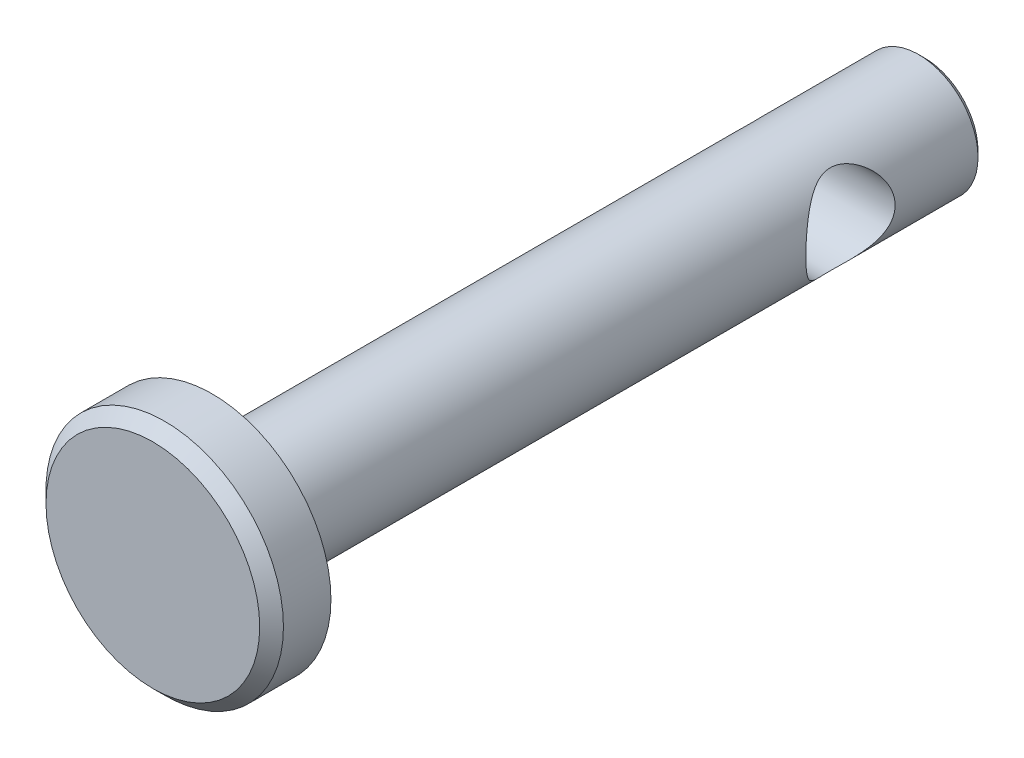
from build123d import *

# Parameters (mm, degrees)
SKETCH1_R           = 1.5875
EXTRUDE1_DEPTH      = 9.525
SKETCH2_R           = 3.175
EXTRUDE2_DEPTH      = 1.5875
CHAMFER1_SIZE       = 0.3175
EXTRUDE3_DEPTH      = 12.985362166
EXTRUDE3_DEPTH_BACK = 12.985362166
SKETCH3_R           = 1.1938
CHAMFER2_SIZE       = 0.15875


with BuildPart() as part:
    # Sketch1 → Extrude1 (new, symmetric)
    with BuildSketch(Plane.XY):
        with Locations(Location((0, 0, 0), (0, 0, 180))):
            Circle(SKETCH1_R)
    extrude(amount=EXTRUDE1_DEPTH, both=True)

    # Sketch2 → Extrude2 (add)
    with BuildSketch(Plane.XY.offset(9.525)):
        Circle(SKETCH2_R)
    extrude(amount=EXTRUDE2_DEPTH)

    # Chamfer1
    chamfer1_edges = [part.edges().sort_by_distance(p)[0] for p in [
        (-3.175, 0, 11.1125),
    ]]
    chamfer(chamfer1_edges, length=CHAMFER1_SIZE)

    # Sketch3 → Extrude3 (cut, two sides: drawn at the far end of the back side and taken through both)
    with BuildSketch(Plane(origin=(0, 0, 0), x_dir=(0, 0, -1), z_dir=(1, 0, 0)).offset(-EXTRUDE3_DEPTH_BACK)):
        with Locations(Location((5.9563, 0, 0), (0, 0, 180))):
            Circle(SKETCH3_R)
    extrude(amount=EXTRUDE3_DEPTH + EXTRUDE3_DEPTH_BACK, mode=Mode.SUBTRACT)

    # Chamfer2
    chamfer2_edges = [part.edges().sort_by_distance(p)[0] for p in [
        (1.5875, 0, -9.525),
    ]]
    chamfer(chamfer2_edges, length=CHAMFER2_SIZE)


solid = part.part
